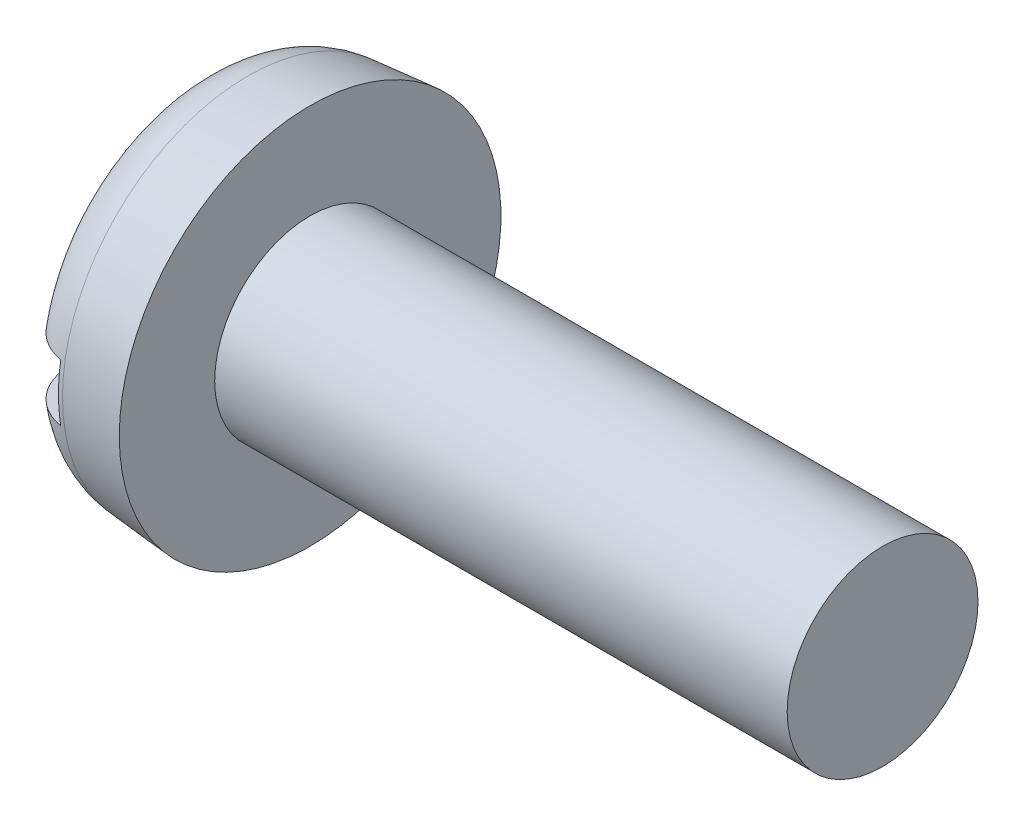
from build123d import *

# Parameters (mm, degrees)
FILLET2_R  = 1.2
SKETCH2_W  = 8
SKETCH2_H  = 1.2
SLOT_DEPTH = 1


with BuildPart() as part:
    # BodySke → Base-Revolve (revolve)
    with BuildSketch(Plane.XY, mode=Mode.PRIVATE) as base_revolve_sk:
        Polygon((2.4, 2), (2.4, 4), (0, 3.790027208), (0, 0), (14.4, 0), (14.4, 2), align=None)
    revolve(base_revolve_sk.sketch.rotate(Axis((-25.4, 0, 0), (1, 0, 0)), 90), axis=Axis((-25.4, 0, 0), (1, 0, 0)))

    # Fillet2
    fillet2_edges = [part.edges().sort_by_distance(p)[0] for p in [
        (0, 0, -3.790027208),
    ]]
    fillet(fillet2_edges, radius=FILLET2_R)

    # Sketch2 → Slot (cut)
    with BuildSketch(Plane(origin=(0, 0, 0), x_dir=(0, 0, -1), z_dir=(1, 0, 0))):
        Rectangle(SKETCH2_W, SKETCH2_H)
    extrude(amount=SLOT_DEPTH, mode=Mode.SUBTRACT)


solid = part.part
